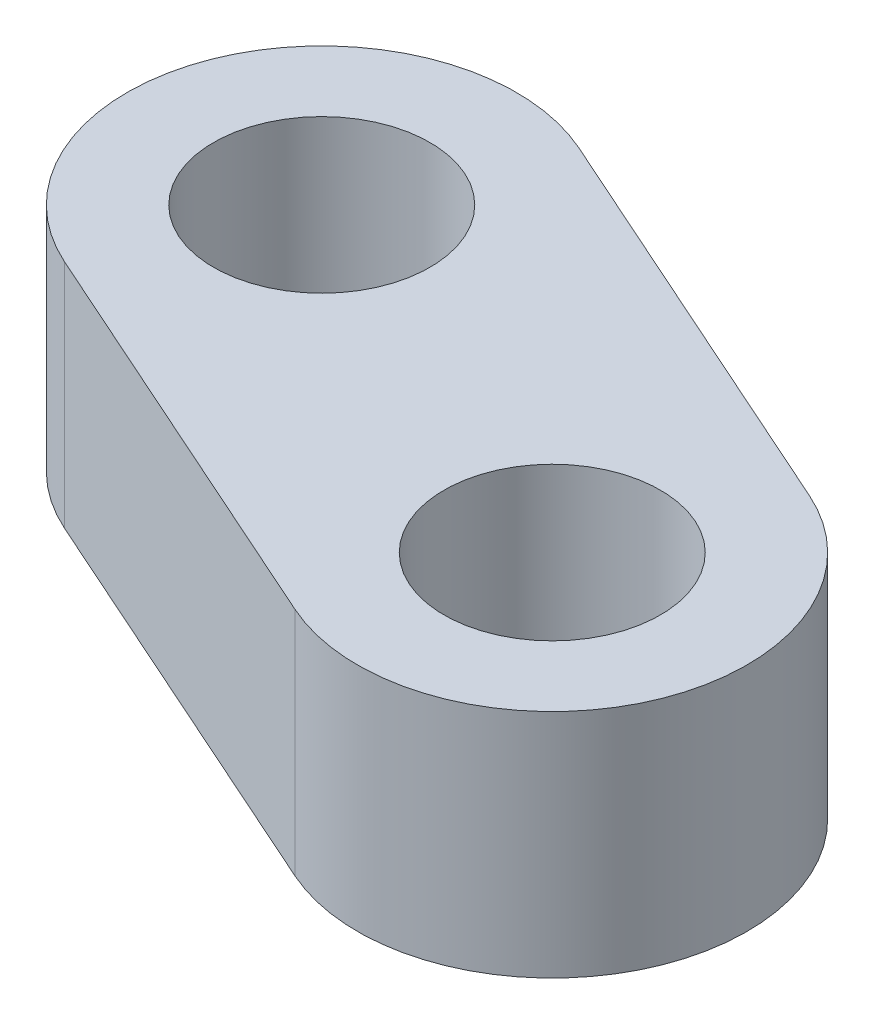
ISO-10303-21;
HEADER;
FILE_DESCRIPTION(('STEP AP214'),'2;1');
FILE_NAME('part.step','',(''),(''),'','','');
FILE_SCHEMA(('AUTOMOTIVE_DESIGN { 1 0 10303 214 1 1 1 1 }'));
ENDSEC;
DATA;
#1=APPLICATION_CONTEXT('core data for automotive mechanical design processes');
#2=APPLICATION_PROTOCOL_DEFINITION('international standard','automotive_design',2000,#1);
#3=PRODUCT_CONTEXT('',#1,'mechanical');
#4=PRODUCT('Part','Part','',(#3));
#5=PRODUCT_RELATED_PRODUCT_CATEGORY('part','',(#4));
#6=PRODUCT_DEFINITION_FORMATION('','',#4);
#7=PRODUCT_DEFINITION_CONTEXT('part definition',#1,'design');
#8=PRODUCT_DEFINITION('design','',#6,#7);
#9=PRODUCT_DEFINITION_SHAPE('','',#8);
#10=(LENGTH_UNIT() NAMED_UNIT(*) SI_UNIT(.MILLI.,.METRE.));
#11=(NAMED_UNIT(*) PLANE_ANGLE_UNIT() SI_UNIT($,.RADIAN.));
#12=(NAMED_UNIT(*) SI_UNIT($,.STERADIAN.) SOLID_ANGLE_UNIT());
#13=UNCERTAINTY_MEASURE_WITH_UNIT(LENGTH_MEASURE(1.E-05),#10,'distance_accuracy_value','');
#14=(GEOMETRIC_REPRESENTATION_CONTEXT(3) GLOBAL_UNCERTAINTY_ASSIGNED_CONTEXT((#13)) GLOBAL_UNIT_ASSIGNED_CONTEXT((#10,
#11,#12)) REPRESENTATION_CONTEXT('',''));
#15=CARTESIAN_POINT('',(0.,0.,0.));
#16=DIRECTION('',(0.,0.,1.));
#17=DIRECTION('',(1.,0.,0.));
#18=AXIS2_PLACEMENT_3D('',#15,#16,#17);
#19=CARTESIAN_POINT('',(-0.0187500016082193,0.,-8.08724678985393));
#20=DIRECTION('',(0.,1.,0.));
#21=DIRECTION('',(0.913158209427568,0.,0.407605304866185));
#22=AXIS2_PLACEMENT_3D('',#19,#20,#21);
#23=CYLINDRICAL_SURFACE('',#22,2.7);
#24=DIRECTION('',(0.,-1.,0.));
#25=VECTOR('',#24,1.);
#26=CARTESIAN_POINT('',(1.08178432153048,0.,-10.5527739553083));
#27=LINE('',#26,#25);
#28=CARTESIAN_POINT('',(1.08178432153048,-1.60000000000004,-10.5527739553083));
#29=VERTEX_POINT('',#28);
#30=CARTESIAN_POINT('',(1.08178432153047,1.59999999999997,-10.5527739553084));
#31=VERTEX_POINT('',#30);
#32=EDGE_CURVE('E57',#29,#31,#27,.F.);
#33=ORIENTED_EDGE('',*,*,#32,.T.);
#34=CARTESIAN_POINT('',(-0.0187500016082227,1.59999999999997,-8.08724678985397));
#35=DIRECTION('',(0.,1.,0.));
#36=DIRECTION('',(0.913158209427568,0.,0.407605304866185));
#37=AXIS2_PLACEMENT_3D('',#34,#35,#36);
#38=CIRCLE('',#37,2.7);
#39=CARTESIAN_POINT('',(-1.11928432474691,1.59999999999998,-5.62171962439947));
#40=VERTEX_POINT('',#39);
#41=EDGE_CURVE('E65',#31,#40,#38,.F.);
#42=ORIENTED_EDGE('',*,*,#41,.T.);
#43=DIRECTION('',(0.,1.,0.));
#44=VECTOR('',#43,1.);
#45=CARTESIAN_POINT('',(-1.11928432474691,0.,-5.62171962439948));
#46=LINE('',#45,#44);
#47=CARTESIAN_POINT('',(-1.1192843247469,-1.60000000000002,-5.62171962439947));
#48=VERTEX_POINT('',#47);
#49=EDGE_CURVE('E62',#40,#48,#46,.F.);
#50=ORIENTED_EDGE('',*,*,#49,.T.);
#51=CARTESIAN_POINT('',(-0.0187500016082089,-1.60000000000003,-8.08724678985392));
#52=DIRECTION('',(0.,1.,0.));
#53=DIRECTION('',(0.913158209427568,0.,0.407605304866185));
#54=AXIS2_PLACEMENT_3D('',#51,#52,#53);
#55=CIRCLE('',#54,2.7);
#56=EDGE_CURVE('E21',#48,#29,#55,.T.);
#57=ORIENTED_EDGE('',*,*,#56,.T.);
#58=EDGE_LOOP('',(#33,#42,#50,#57));
#59=FACE_BOUND('',#58,.T.);
#60=ADVANCED_FACE('F17',(#59),#23,.T.);
#61=CARTESIAN_POINT('',(-4.68937556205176,0.,-13.1288394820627));
#62=DIRECTION('',(-0.407605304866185,0.,0.913158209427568));
#63=DIRECTION('',(-0.913158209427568,0.,-0.407605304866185));
#64=AXIS2_PLACEMENT_3D('',#61,#62,#63);
#65=PLANE('',#64);
#66=ORIENTED_EDGE('',*,*,#32,.F.);
#67=DIRECTION('',(0.913158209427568,0.,0.407605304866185));
#68=VECTOR('',#67,1.);
#69=CARTESIAN_POINT('',(-4.68937556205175,-1.60000000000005,-13.1288394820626));
#70=LINE('',#69,#68);
#71=CARTESIAN_POINT('',(-4.68937556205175,-1.60000000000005,-13.1288394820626));
#72=VERTEX_POINT('',#71);
#73=EDGE_CURVE('E76',#29,#72,#70,.F.);
#74=ORIENTED_EDGE('',*,*,#73,.T.);
#75=DIRECTION('',(0.,1.,0.));
#76=VECTOR('',#75,1.);
#77=CARTESIAN_POINT('',(-4.68937556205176,0.,-13.1288394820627));
#78=LINE('',#77,#76);
#79=CARTESIAN_POINT('',(-4.68937556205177,1.59999999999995,-13.1288394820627));
#80=VERTEX_POINT('',#79);
#81=EDGE_CURVE('E91',#80,#72,#78,.F.);
#82=ORIENTED_EDGE('',*,*,#81,.F.);
#83=DIRECTION('',(-0.913158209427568,0.,-0.407605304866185));
#84=VECTOR('',#83,1.);
#85=CARTESIAN_POINT('',(-4.68937556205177,1.59999999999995,-13.1288394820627));
#86=LINE('',#85,#84);
#87=EDGE_CURVE('E92',#31,#80,#86,.T.);
#88=ORIENTED_EDGE('',*,*,#87,.F.);
#89=EDGE_LOOP('',(#66,#74,#82,#88));
#90=FACE_BOUND('',#89,.T.);
#91=ADVANCED_FACE('F90',(#90),#65,.F.);
#92=CARTESIAN_POINT('',(-5.78990988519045,1.59999999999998,-10.6633123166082));
#93=DIRECTION('',(0.,1.,0.));
#94=DIRECTION('',(0.913158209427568,0.,0.407605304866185));
#95=AXIS2_PLACEMENT_3D('',#92,#93,#94);
#96=PLANE('',#95);
#97=CARTESIAN_POINT('',(-5.78990988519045,1.59999999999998,-10.6633123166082));
#98=DIRECTION('',(0.,1.,0.));
#99=DIRECTION('',(0.913158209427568,0.,0.407605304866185));
#100=AXIS2_PLACEMENT_3D('',#97,#98,#99);
#101=CIRCLE('',#100,1.5);
#102=CARTESIAN_POINT('',(-4.4201725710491,1.59999999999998,-10.0519043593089));
#103=VERTEX_POINT('',#102);
#104=EDGE_CURVE('E11',#103,#103,#101,.F.);
#105=ORIENTED_EDGE('',*,*,#104,.T.);
#106=EDGE_LOOP('',(#105));
#107=FACE_BOUND('',#106,.T.);
#108=ORIENTED_EDGE('',*,*,#41,.F.);
#109=ORIENTED_EDGE('',*,*,#87,.T.);
#110=CARTESIAN_POINT('',(-5.78990988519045,1.59999999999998,-10.6633123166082));
#111=DIRECTION('',(0.,1.,0.));
#112=DIRECTION('',(0.913158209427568,0.,0.407605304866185));
#113=AXIS2_PLACEMENT_3D('',#110,#111,#112);
#114=CIRCLE('',#113,2.7);
#115=CARTESIAN_POINT('',(-6.89044420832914,1.59999999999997,-8.1977851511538));
#116=VERTEX_POINT('',#115);
#117=EDGE_CURVE('E36',#116,#80,#114,.F.);
#118=ORIENTED_EDGE('',*,*,#117,.F.);
#119=DIRECTION('',(-0.913158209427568,0.,-0.407605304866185));
#120=VECTOR('',#119,1.);
#121=CARTESIAN_POINT('',(-6.89044420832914,1.59999999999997,-8.19778515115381));
#122=LINE('',#121,#120);
#123=EDGE_CURVE('E69',#116,#40,#122,.F.);
#124=ORIENTED_EDGE('',*,*,#123,.T.);
#125=EDGE_LOOP('',(#108,#109,#118,#124));
#126=FACE_BOUND('',#125,.T.);
#127=CARTESIAN_POINT('',(-0.0187500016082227,1.59999999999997,-8.08724678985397));
#128=DIRECTION('',(0.,1.,0.));
#129=DIRECTION('',(0.913158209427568,0.,0.407605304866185));
#130=AXIS2_PLACEMENT_3D('',#127,#128,#129);
#131=CIRCLE('',#130,1.5);
#132=CARTESIAN_POINT('',(1.35098731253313,1.59999999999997,-7.47583883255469));
#133=VERTEX_POINT('',#132);
#134=EDGE_CURVE('E27',#133,#133,#131,.F.);
#135=ORIENTED_EDGE('',*,*,#134,.T.);
#136=EDGE_LOOP('',(#135));
#137=FACE_BOUND('',#136,.T.);
#138=ADVANCED_FACE('F103',(#107,#126,#137),#96,.T.);
#139=CARTESIAN_POINT('',(-6.89044420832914,0.,-8.19778515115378));
#140=DIRECTION('',(0.407605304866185,0.,-0.913158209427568));
#141=DIRECTION('',(0.,-1.,0.));
#142=AXIS2_PLACEMENT_3D('',#139,#140,#141);
#143=PLANE('',#142);
#144=DIRECTION('',(0.,1.,0.));
#145=VECTOR('',#144,1.);
#146=CARTESIAN_POINT('',(-6.89044420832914,0.,-8.19778515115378));
#147=LINE('',#146,#145);
#148=CARTESIAN_POINT('',(-6.89044420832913,-1.60000000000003,-8.19778515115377));
#149=VERTEX_POINT('',#148);
#150=EDGE_CURVE('E78',#149,#116,#147,.T.);
#151=ORIENTED_EDGE('',*,*,#150,.F.);
#152=DIRECTION('',(0.913158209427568,0.,0.407605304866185));
#153=VECTOR('',#152,1.);
#154=CARTESIAN_POINT('',(-6.89044420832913,-1.60000000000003,-8.19778515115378));
#155=LINE('',#154,#153);
#156=EDGE_CURVE('E74',#149,#48,#155,.T.);
#157=ORIENTED_EDGE('',*,*,#156,.T.);
#158=ORIENTED_EDGE('',*,*,#49,.F.);
#159=ORIENTED_EDGE('',*,*,#123,.F.);
#160=EDGE_LOOP('',(#151,#157,#158,#159));
#161=FACE_BOUND('',#160,.T.);
#162=ADVANCED_FACE('F77',(#161),#143,.F.);
#163=CARTESIAN_POINT('',(-5.78990988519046,0.,-10.6633123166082));
#164=DIRECTION('',(0.,1.,0.));
#165=DIRECTION('',(0.913158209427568,0.,0.407605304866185));
#166=AXIS2_PLACEMENT_3D('',#163,#164,#165);
#167=CYLINDRICAL_SURFACE('',#166,2.7);
#168=ORIENTED_EDGE('',*,*,#81,.T.);
#169=CARTESIAN_POINT('',(-5.78990988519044,-1.60000000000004,-10.6633123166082));
#170=DIRECTION('',(0.,1.,0.));
#171=DIRECTION('',(0.913158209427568,0.,0.407605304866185));
#172=AXIS2_PLACEMENT_3D('',#169,#170,#171);
#173=CIRCLE('',#172,2.7);
#174=EDGE_CURVE('E88',#72,#149,#173,.T.);
#175=ORIENTED_EDGE('',*,*,#174,.T.);
#176=ORIENTED_EDGE('',*,*,#150,.T.);
#177=ORIENTED_EDGE('',*,*,#117,.T.);
#178=EDGE_LOOP('',(#168,#175,#176,#177));
#179=FACE_BOUND('',#178,.T.);
#180=ADVANCED_FACE('F109',(#179),#167,.T.);
#181=CARTESIAN_POINT('',(-0.0187500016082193,0.,-8.08724678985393));
#182=DIRECTION('',(0.,1.,0.));
#183=DIRECTION('',(0.913158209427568,0.,0.407605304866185));
#184=AXIS2_PLACEMENT_3D('',#181,#182,#183);
#185=CYLINDRICAL_SURFACE('',#184,1.5);
#186=ORIENTED_EDGE('',*,*,#134,.F.);
#187=EDGE_LOOP('',(#186));
#188=FACE_BOUND('',#187,.T.);
#189=CARTESIAN_POINT('',(-0.0187500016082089,-1.60000000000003,-8.08724678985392));
#190=DIRECTION('',(0.,1.,0.));
#191=DIRECTION('',(0.913158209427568,0.,0.407605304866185));
#192=AXIS2_PLACEMENT_3D('',#189,#190,#191);
#193=CIRCLE('',#192,1.5);
#194=CARTESIAN_POINT('',(1.35098731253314,-1.60000000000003,-7.47583883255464));
#195=VERTEX_POINT('',#194);
#196=EDGE_CURVE('E86',#195,#195,#193,.F.);
#197=ORIENTED_EDGE('',*,*,#196,.T.);
#198=EDGE_LOOP('',(#197));
#199=FACE_BOUND('',#198,.T.);
#200=ADVANCED_FACE('F105',(#188,#199),#185,.F.);
#201=CARTESIAN_POINT('',(-5.78990988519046,0.,-10.6633123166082));
#202=DIRECTION('',(0.,1.,0.));
#203=DIRECTION('',(0.913158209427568,0.,0.407605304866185));
#204=AXIS2_PLACEMENT_3D('',#201,#202,#203);
#205=CYLINDRICAL_SURFACE('',#204,1.5);
#206=ORIENTED_EDGE('',*,*,#104,.F.);
#207=EDGE_LOOP('',(#206));
#208=FACE_BOUND('',#207,.T.);
#209=CARTESIAN_POINT('',(-5.78990988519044,-1.60000000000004,-10.6633123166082));
#210=DIRECTION('',(0.,1.,0.));
#211=DIRECTION('',(0.913158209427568,0.,0.407605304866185));
#212=AXIS2_PLACEMENT_3D('',#209,#210,#211);
#213=CIRCLE('',#212,1.5);
#214=CARTESIAN_POINT('',(-4.42017257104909,-1.60000000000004,-10.0519043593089));
#215=VERTEX_POINT('',#214);
#216=EDGE_CURVE('E83',#215,#215,#213,.F.);
#217=ORIENTED_EDGE('',*,*,#216,.T.);
#218=EDGE_LOOP('',(#217));
#219=FACE_BOUND('',#218,.T.);
#220=ADVANCED_FACE('F108',(#208,#219),#205,.F.);
#221=CARTESIAN_POINT('',(-5.78990988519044,-1.60000000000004,-10.6633123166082));
#222=DIRECTION('',(0.,1.,0.));
#223=DIRECTION('',(0.913158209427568,0.,0.407605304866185));
#224=AXIS2_PLACEMENT_3D('',#221,#222,#223);
#225=PLANE('',#224);
#226=ORIENTED_EDGE('',*,*,#216,.F.);
#227=EDGE_LOOP('',(#226));
#228=FACE_BOUND('',#227,.T.);
#229=ORIENTED_EDGE('',*,*,#196,.F.);
#230=EDGE_LOOP('',(#229));
#231=FACE_BOUND('',#230,.T.);
#232=ORIENTED_EDGE('',*,*,#73,.F.);
#233=ORIENTED_EDGE('',*,*,#56,.F.);
#234=ORIENTED_EDGE('',*,*,#156,.F.);
#235=ORIENTED_EDGE('',*,*,#174,.F.);
#236=EDGE_LOOP('',(#232,#233,#234,#235));
#237=FACE_BOUND('',#236,.T.);
#238=ADVANCED_FACE('F19',(#228,#231,#237),#225,.F.);
#239=CLOSED_SHELL('',(#60,#91,#138,#162,#180,#200,#220,#238));
#240=MANIFOLD_SOLID_BREP('B1',#239);
#241=ADVANCED_BREP_SHAPE_REPRESENTATION('',(#18,#240),#14);
#242=SHAPE_DEFINITION_REPRESENTATION(#9,#241);
ENDSEC;
END-ISO-10303-21;
